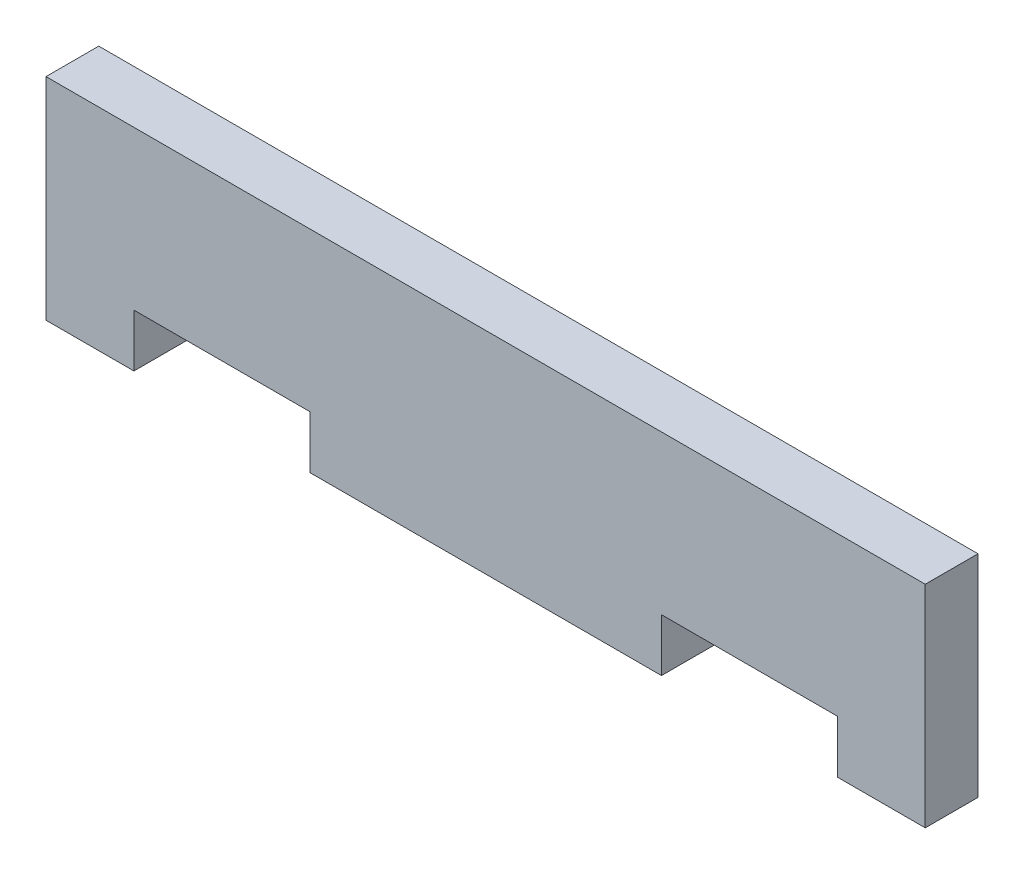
ISO-10303-21;
HEADER;
FILE_DESCRIPTION(('STEP AP214'),'2;1');
FILE_NAME('part.step','',(''),(''),'','','');
FILE_SCHEMA(('AUTOMOTIVE_DESIGN { 1 0 10303 214 1 1 1 1 }'));
ENDSEC;
DATA;
#1=APPLICATION_CONTEXT('core data for automotive mechanical design processes');
#2=APPLICATION_PROTOCOL_DEFINITION('international standard','automotive_design',2000,#1);
#3=PRODUCT_CONTEXT('',#1,'mechanical');
#4=PRODUCT('Part','Part','',(#3));
#5=PRODUCT_RELATED_PRODUCT_CATEGORY('part','',(#4));
#6=PRODUCT_DEFINITION_FORMATION('','',#4);
#7=PRODUCT_DEFINITION_CONTEXT('part definition',#1,'design');
#8=PRODUCT_DEFINITION('design','',#6,#7);
#9=PRODUCT_DEFINITION_SHAPE('','',#8);
#10=(LENGTH_UNIT() NAMED_UNIT(*) SI_UNIT(.MILLI.,.METRE.));
#11=(NAMED_UNIT(*) PLANE_ANGLE_UNIT() SI_UNIT($,.RADIAN.));
#12=(NAMED_UNIT(*) SI_UNIT($,.STERADIAN.) SOLID_ANGLE_UNIT());
#13=UNCERTAINTY_MEASURE_WITH_UNIT(LENGTH_MEASURE(1.E-05),#10,'distance_accuracy_value','');
#14=(GEOMETRIC_REPRESENTATION_CONTEXT(3) GLOBAL_UNCERTAINTY_ASSIGNED_CONTEXT((#13)) GLOBAL_UNIT_ASSIGNED_CONTEXT((#10,
#11,#12)) REPRESENTATION_CONTEXT('',''));
#15=CARTESIAN_POINT('',(0.,0.,0.));
#16=DIRECTION('',(0.,0.,1.));
#17=DIRECTION('',(1.,0.,0.));
#18=AXIS2_PLACEMENT_3D('',#15,#16,#17);
#19=CARTESIAN_POINT('',(0.,0.,3.));
#20=DIRECTION('',(0.,1.,0.));
#21=DIRECTION('',(0.,0.,1.));
#22=AXIS2_PLACEMENT_3D('',#19,#20,#21);
#23=PLANE('',#22);
#24=DIRECTION('',(0.,0.,1.));
#25=VECTOR('',#24,1.);
#26=CARTESIAN_POINT('',(45.,0.,0.));
#27=LINE('',#26,#25);
#28=CARTESIAN_POINT('',(45.,0.,0.));
#29=VERTEX_POINT('',#28);
#30=CARTESIAN_POINT('',(45.,0.,3.));
#31=VERTEX_POINT('',#30);
#32=EDGE_CURVE('E154',#29,#31,#27,.T.);
#33=ORIENTED_EDGE('',*,*,#32,.F.);
#34=DIRECTION('',(1.,0.,0.));
#35=VECTOR('',#34,1.);
#36=CARTESIAN_POINT('',(0.,0.,0.));
#37=LINE('',#36,#35);
#38=CARTESIAN_POINT('',(50.,0.,0.));
#39=VERTEX_POINT('',#38);
#40=EDGE_CURVE('E144',#29,#39,#37,.T.);
#41=ORIENTED_EDGE('',*,*,#40,.T.);
#42=DIRECTION('',(0.,0.,-1.));
#43=VECTOR('',#42,1.);
#44=CARTESIAN_POINT('',(50.,0.,3.));
#45=LINE('',#44,#43);
#46=CARTESIAN_POINT('',(50.,0.,3.));
#47=VERTEX_POINT('',#46);
#48=EDGE_CURVE('E44',#47,#39,#45,.T.);
#49=ORIENTED_EDGE('',*,*,#48,.F.);
#50=DIRECTION('',(1.,0.,0.));
#51=VECTOR('',#50,1.);
#52=CARTESIAN_POINT('',(0.,0.,3.));
#53=LINE('',#52,#51);
#54=EDGE_CURVE('E188',#31,#47,#53,.T.);
#55=ORIENTED_EDGE('',*,*,#54,.F.);
#56=EDGE_LOOP('',(#33,#41,#49,#55));
#57=FACE_BOUND('',#56,.T.);
#58=ADVANCED_FACE('F36',(#57),#23,.F.);
#59=DIRECTION('',(0.,0.,1.));
#60=VECTOR('',#59,1.);
#61=CARTESIAN_POINT('',(35.,0.,0.));
#62=LINE('',#61,#60);
#63=CARTESIAN_POINT('',(35.,0.,0.));
#64=VERTEX_POINT('',#63);
#65=CARTESIAN_POINT('',(35.,0.,3.));
#66=VERTEX_POINT('',#65);
#67=EDGE_CURVE('E157',#64,#66,#62,.T.);
#68=ORIENTED_EDGE('',*,*,#67,.T.);
#69=CARTESIAN_POINT('',(15.,0.,3.));
#70=VERTEX_POINT('',#69);
#71=EDGE_CURVE('E194',#70,#66,#53,.T.);
#72=ORIENTED_EDGE('',*,*,#71,.F.);
#73=DIRECTION('',(0.,0.,1.));
#74=VECTOR('',#73,1.);
#75=CARTESIAN_POINT('',(15.,0.,0.));
#76=LINE('',#75,#74);
#77=CARTESIAN_POINT('',(15.,0.,0.));
#78=VERTEX_POINT('',#77);
#79=EDGE_CURVE('E181',#78,#70,#76,.T.);
#80=ORIENTED_EDGE('',*,*,#79,.F.);
#81=EDGE_CURVE('E205',#78,#64,#37,.T.);
#82=ORIENTED_EDGE('',*,*,#81,.T.);
#83=EDGE_LOOP('',(#68,#72,#80,#82));
#84=FACE_BOUND('',#83,.T.);
#85=ADVANCED_FACE('F238',(#84),#23,.F.);
#86=CARTESIAN_POINT('',(0.,0.,3.));
#87=DIRECTION('',(0.,0.,-1.));
#88=DIRECTION('',(-1.,0.,0.));
#89=AXIS2_PLACEMENT_3D('',#86,#87,#88);
#90=PLANE('',#89);
#91=DIRECTION('',(0.,-1.,0.));
#92=VECTOR('',#91,1.);
#93=CARTESIAN_POINT('',(45.,0.,3.));
#94=LINE('',#93,#92);
#95=CARTESIAN_POINT('',(45.,3.,3.));
#96=VERTEX_POINT('',#95);
#97=EDGE_CURVE('E138',#96,#31,#94,.T.);
#98=ORIENTED_EDGE('',*,*,#97,.T.);
#99=ORIENTED_EDGE('',*,*,#54,.T.);
#100=DIRECTION('',(0.,1.,0.));
#101=VECTOR('',#100,1.);
#102=CARTESIAN_POINT('',(50.,0.,3.));
#103=LINE('',#102,#101);
#104=CARTESIAN_POINT('',(50.,12.,3.));
#105=VERTEX_POINT('',#104);
#106=EDGE_CURVE('E193',#47,#105,#103,.T.);
#107=ORIENTED_EDGE('',*,*,#106,.T.);
#108=DIRECTION('',(-1.,0.,0.));
#109=VECTOR('',#108,1.);
#110=CARTESIAN_POINT('',(0.,12.,3.));
#111=LINE('',#110,#109);
#112=CARTESIAN_POINT('',(0.,12.,3.));
#113=VERTEX_POINT('',#112);
#114=EDGE_CURVE('E196',#105,#113,#111,.T.);
#115=ORIENTED_EDGE('',*,*,#114,.T.);
#116=DIRECTION('',(0.,-1.,0.));
#117=VECTOR('',#116,1.);
#118=CARTESIAN_POINT('',(0.,0.,3.));
#119=LINE('',#118,#117);
#120=CARTESIAN_POINT('',(0.,0.,3.));
#121=VERTEX_POINT('',#120);
#122=EDGE_CURVE('E185',#113,#121,#119,.T.);
#123=ORIENTED_EDGE('',*,*,#122,.T.);
#124=CARTESIAN_POINT('',(5.,0.,3.));
#125=VERTEX_POINT('',#124);
#126=EDGE_CURVE('E190',#121,#125,#53,.T.);
#127=ORIENTED_EDGE('',*,*,#126,.T.);
#128=DIRECTION('',(0.,-1.,0.));
#129=VECTOR('',#128,1.);
#130=CARTESIAN_POINT('',(5.,0.,3.));
#131=LINE('',#130,#129);
#132=CARTESIAN_POINT('',(5.,3.,3.));
#133=VERTEX_POINT('',#132);
#134=EDGE_CURVE('E156',#133,#125,#131,.T.);
#135=ORIENTED_EDGE('',*,*,#134,.F.);
#136=DIRECTION('',(-1.,0.,0.));
#137=VECTOR('',#136,1.);
#138=CARTESIAN_POINT('',(5.,3.,3.));
#139=LINE('',#138,#137);
#140=CARTESIAN_POINT('',(15.,3.,3.));
#141=VERTEX_POINT('',#140);
#142=EDGE_CURVE('E165',#141,#133,#139,.T.);
#143=ORIENTED_EDGE('',*,*,#142,.F.);
#144=DIRECTION('',(0.,1.,0.));
#145=VECTOR('',#144,1.);
#146=CARTESIAN_POINT('',(15.,0.,3.));
#147=LINE('',#146,#145);
#148=EDGE_CURVE('E171',#70,#141,#147,.T.);
#149=ORIENTED_EDGE('',*,*,#148,.F.);
#150=ORIENTED_EDGE('',*,*,#71,.T.);
#151=DIRECTION('',(0.,1.,0.));
#152=VECTOR('',#151,1.);
#153=CARTESIAN_POINT('',(35.,0.,3.));
#154=LINE('',#153,#152);
#155=CARTESIAN_POINT('',(35.,3.,3.));
#156=VERTEX_POINT('',#155);
#157=EDGE_CURVE('E145',#66,#156,#154,.T.);
#158=ORIENTED_EDGE('',*,*,#157,.T.);
#159=DIRECTION('',(1.,0.,0.));
#160=VECTOR('',#159,1.);
#161=CARTESIAN_POINT('',(45.,3.,3.));
#162=LINE('',#161,#160);
#163=EDGE_CURVE('E148',#156,#96,#162,.T.);
#164=ORIENTED_EDGE('',*,*,#163,.T.);
#165=EDGE_LOOP('',(#98,#99,#107,#115,#123,#127,#135,#143,#149,#150,#158,#164));
#166=FACE_BOUND('',#165,.T.);
#167=ADVANCED_FACE('F230',(#166),#90,.F.);
#168=CARTESIAN_POINT('',(0.,0.,0.));
#169=DIRECTION('',(0.,0.,-1.));
#170=DIRECTION('',(-1.,0.,0.));
#171=AXIS2_PLACEMENT_3D('',#168,#169,#170);
#172=PLANE('',#171);
#173=ORIENTED_EDGE('',*,*,#40,.F.);
#174=DIRECTION('',(0.,-1.,0.));
#175=VECTOR('',#174,1.);
#176=CARTESIAN_POINT('',(45.,0.,0.));
#177=LINE('',#176,#175);
#178=CARTESIAN_POINT('',(45.,3.,0.));
#179=VERTEX_POINT('',#178);
#180=EDGE_CURVE('E132',#179,#29,#177,.T.);
#181=ORIENTED_EDGE('',*,*,#180,.F.);
#182=DIRECTION('',(1.,0.,0.));
#183=VECTOR('',#182,1.);
#184=CARTESIAN_POINT('',(45.,3.,0.));
#185=LINE('',#184,#183);
#186=CARTESIAN_POINT('',(35.,3.,0.));
#187=VERTEX_POINT('',#186);
#188=EDGE_CURVE('E123',#187,#179,#185,.T.);
#189=ORIENTED_EDGE('',*,*,#188,.F.);
#190=DIRECTION('',(0.,1.,0.));
#191=VECTOR('',#190,1.);
#192=CARTESIAN_POINT('',(35.,0.,0.));
#193=LINE('',#192,#191);
#194=EDGE_CURVE('E131',#64,#187,#193,.T.);
#195=ORIENTED_EDGE('',*,*,#194,.F.);
#196=ORIENTED_EDGE('',*,*,#81,.F.);
#197=DIRECTION('',(0.,1.,0.));
#198=VECTOR('',#197,1.);
#199=CARTESIAN_POINT('',(15.,0.,0.));
#200=LINE('',#199,#198);
#201=CARTESIAN_POINT('',(15.,3.,0.));
#202=VERTEX_POINT('',#201);
#203=EDGE_CURVE('E164',#78,#202,#200,.T.);
#204=ORIENTED_EDGE('',*,*,#203,.T.);
#205=DIRECTION('',(-1.,0.,0.));
#206=VECTOR('',#205,1.);
#207=CARTESIAN_POINT('',(5.,3.,0.));
#208=LINE('',#207,#206);
#209=CARTESIAN_POINT('',(5.,3.,0.));
#210=VERTEX_POINT('',#209);
#211=EDGE_CURVE('E59',#202,#210,#208,.T.);
#212=ORIENTED_EDGE('',*,*,#211,.T.);
#213=DIRECTION('',(0.,-1.,0.));
#214=VECTOR('',#213,1.);
#215=CARTESIAN_POINT('',(5.,0.,0.));
#216=LINE('',#215,#214);
#217=CARTESIAN_POINT('',(5.,0.,0.));
#218=VERTEX_POINT('',#217);
#219=EDGE_CURVE('E161',#210,#218,#216,.T.);
#220=ORIENTED_EDGE('',*,*,#219,.T.);
#221=CARTESIAN_POINT('',(0.,0.,0.));
#222=VERTEX_POINT('',#221);
#223=EDGE_CURVE('E201',#222,#218,#37,.T.);
#224=ORIENTED_EDGE('',*,*,#223,.F.);
#225=DIRECTION('',(0.,-1.,0.));
#226=VECTOR('',#225,1.);
#227=CARTESIAN_POINT('',(0.,0.,0.));
#228=LINE('',#227,#226);
#229=CARTESIAN_POINT('',(0.,12.,0.));
#230=VERTEX_POINT('',#229);
#231=EDGE_CURVE('E178',#230,#222,#228,.T.);
#232=ORIENTED_EDGE('',*,*,#231,.F.);
#233=DIRECTION('',(-1.,0.,0.));
#234=VECTOR('',#233,1.);
#235=CARTESIAN_POINT('',(0.,12.,0.));
#236=LINE('',#235,#234);
#237=CARTESIAN_POINT('',(50.,12.,0.));
#238=VERTEX_POINT('',#237);
#239=EDGE_CURVE('E189',#238,#230,#236,.T.);
#240=ORIENTED_EDGE('',*,*,#239,.F.);
#241=DIRECTION('',(0.,1.,0.));
#242=VECTOR('',#241,1.);
#243=CARTESIAN_POINT('',(50.,0.,0.));
#244=LINE('',#243,#242);
#245=EDGE_CURVE('E204',#39,#238,#244,.T.);
#246=ORIENTED_EDGE('',*,*,#245,.F.);
#247=EDGE_LOOP('',(#173,#181,#189,#195,#196,#204,#212,#220,#224,#232,#240,#246));
#248=FACE_BOUND('',#247,.T.);
#249=ADVANCED_FACE('F142',(#248),#172,.T.);
#250=ORIENTED_EDGE('',*,*,#223,.T.);
#251=DIRECTION('',(0.,0.,1.));
#252=VECTOR('',#251,1.);
#253=CARTESIAN_POINT('',(5.,0.,0.));
#254=LINE('',#253,#252);
#255=EDGE_CURVE('E169',#218,#125,#254,.T.);
#256=ORIENTED_EDGE('',*,*,#255,.T.);
#257=ORIENTED_EDGE('',*,*,#126,.F.);
#258=DIRECTION('',(0.,0.,-1.));
#259=VECTOR('',#258,1.);
#260=CARTESIAN_POINT('',(0.,0.,3.));
#261=LINE('',#260,#259);
#262=EDGE_CURVE('E11',#121,#222,#261,.T.);
#263=ORIENTED_EDGE('',*,*,#262,.T.);
#264=EDGE_LOOP('',(#250,#256,#257,#263));
#265=FACE_BOUND('',#264,.T.);
#266=ADVANCED_FACE('F244',(#265),#23,.F.);
#267=CARTESIAN_POINT('',(0.,0.,3.));
#268=DIRECTION('',(1.,0.,0.));
#269=DIRECTION('',(0.,0.,-1.));
#270=AXIS2_PLACEMENT_3D('',#267,#268,#269);
#271=PLANE('',#270);
#272=ORIENTED_EDGE('',*,*,#231,.T.);
#273=ORIENTED_EDGE('',*,*,#262,.F.);
#274=ORIENTED_EDGE('',*,*,#122,.F.);
#275=DIRECTION('',(0.,0.,-1.));
#276=VECTOR('',#275,1.);
#277=CARTESIAN_POINT('',(0.,12.,3.));
#278=LINE('',#277,#276);
#279=EDGE_CURVE('E198',#113,#230,#278,.T.);
#280=ORIENTED_EDGE('',*,*,#279,.T.);
#281=EDGE_LOOP('',(#272,#273,#274,#280));
#282=FACE_BOUND('',#281,.T.);
#283=ADVANCED_FACE('F38',(#282),#271,.F.);
#284=CARTESIAN_POINT('',(50.,0.,3.));
#285=DIRECTION('',(-1.,0.,0.));
#286=DIRECTION('',(0.,0.,1.));
#287=AXIS2_PLACEMENT_3D('',#284,#285,#286);
#288=PLANE('',#287);
#289=ORIENTED_EDGE('',*,*,#245,.T.);
#290=DIRECTION('',(0.,0.,-1.));
#291=VECTOR('',#290,1.);
#292=CARTESIAN_POINT('',(50.,12.,3.));
#293=LINE('',#292,#291);
#294=EDGE_CURVE('E210',#105,#238,#293,.T.);
#295=ORIENTED_EDGE('',*,*,#294,.F.);
#296=ORIENTED_EDGE('',*,*,#106,.F.);
#297=ORIENTED_EDGE('',*,*,#48,.T.);
#298=EDGE_LOOP('',(#289,#295,#296,#297));
#299=FACE_BOUND('',#298,.T.);
#300=ADVANCED_FACE('F216',(#299),#288,.F.);
#301=CARTESIAN_POINT('',(0.,12.,3.));
#302=DIRECTION('',(0.,-1.,0.));
#303=DIRECTION('',(0.,0.,-1.));
#304=AXIS2_PLACEMENT_3D('',#301,#302,#303);
#305=PLANE('',#304);
#306=ORIENTED_EDGE('',*,*,#239,.T.);
#307=ORIENTED_EDGE('',*,*,#279,.F.);
#308=ORIENTED_EDGE('',*,*,#114,.F.);
#309=ORIENTED_EDGE('',*,*,#294,.T.);
#310=EDGE_LOOP('',(#306,#307,#308,#309));
#311=FACE_BOUND('',#310,.T.);
#312=ADVANCED_FACE('F224',(#311),#305,.F.);
#313=CARTESIAN_POINT('',(5.,0.,0.));
#314=DIRECTION('',(-1.,0.,0.));
#315=DIRECTION('',(0.,0.,1.));
#316=AXIS2_PLACEMENT_3D('',#313,#314,#315);
#317=PLANE('',#316);
#318=ORIENTED_EDGE('',*,*,#134,.T.);
#319=ORIENTED_EDGE('',*,*,#255,.F.);
#320=ORIENTED_EDGE('',*,*,#219,.F.);
#321=DIRECTION('',(0.,0.,1.));
#322=VECTOR('',#321,1.);
#323=CARTESIAN_POINT('',(5.,3.,0.));
#324=LINE('',#323,#322);
#325=EDGE_CURVE('E176',#210,#133,#324,.T.);
#326=ORIENTED_EDGE('',*,*,#325,.T.);
#327=EDGE_LOOP('',(#318,#319,#320,#326));
#328=FACE_BOUND('',#327,.T.);
#329=ADVANCED_FACE('F258',(#328),#317,.F.);
#330=CARTESIAN_POINT('',(5.,3.,0.));
#331=DIRECTION('',(0.,1.,0.));
#332=DIRECTION('',(-1.,0.,0.));
#333=AXIS2_PLACEMENT_3D('',#330,#331,#332);
#334=PLANE('',#333);
#335=ORIENTED_EDGE('',*,*,#142,.T.);
#336=ORIENTED_EDGE('',*,*,#325,.F.);
#337=ORIENTED_EDGE('',*,*,#211,.F.);
#338=DIRECTION('',(0.,0.,1.));
#339=VECTOR('',#338,1.);
#340=CARTESIAN_POINT('',(15.,3.,0.));
#341=LINE('',#340,#339);
#342=EDGE_CURVE('E179',#202,#141,#341,.T.);
#343=ORIENTED_EDGE('',*,*,#342,.T.);
#344=EDGE_LOOP('',(#335,#336,#337,#343));
#345=FACE_BOUND('',#344,.T.);
#346=ADVANCED_FACE('F259',(#345),#334,.F.);
#347=CARTESIAN_POINT('',(15.,0.,0.));
#348=DIRECTION('',(1.,0.,0.));
#349=DIRECTION('',(0.,0.,-1.));
#350=AXIS2_PLACEMENT_3D('',#347,#348,#349);
#351=PLANE('',#350);
#352=ORIENTED_EDGE('',*,*,#148,.T.);
#353=ORIENTED_EDGE('',*,*,#342,.F.);
#354=ORIENTED_EDGE('',*,*,#203,.F.);
#355=ORIENTED_EDGE('',*,*,#79,.T.);
#356=EDGE_LOOP('',(#352,#353,#354,#355));
#357=FACE_BOUND('',#356,.T.);
#358=ADVANCED_FACE('F261',(#357),#351,.F.);
#359=CARTESIAN_POINT('',(45.,0.,0.));
#360=DIRECTION('',(-1.,0.,0.));
#361=DIRECTION('',(0.,0.,1.));
#362=AXIS2_PLACEMENT_3D('',#359,#360,#361);
#363=PLANE('',#362);
#364=ORIENTED_EDGE('',*,*,#97,.F.);
#365=DIRECTION('',(0.,0.,1.));
#366=VECTOR('',#365,1.);
#367=CARTESIAN_POINT('',(45.,3.,0.));
#368=LINE('',#367,#366);
#369=EDGE_CURVE('E126',#179,#96,#368,.T.);
#370=ORIENTED_EDGE('',*,*,#369,.F.);
#371=ORIENTED_EDGE('',*,*,#180,.T.);
#372=ORIENTED_EDGE('',*,*,#32,.T.);
#373=EDGE_LOOP('',(#364,#370,#371,#372));
#374=FACE_BOUND('',#373,.T.);
#375=ADVANCED_FACE('F135',(#374),#363,.T.);
#376=CARTESIAN_POINT('',(35.,0.,0.));
#377=DIRECTION('',(1.,0.,0.));
#378=DIRECTION('',(0.,0.,-1.));
#379=AXIS2_PLACEMENT_3D('',#376,#377,#378);
#380=PLANE('',#379);
#381=ORIENTED_EDGE('',*,*,#157,.F.);
#382=ORIENTED_EDGE('',*,*,#67,.F.);
#383=ORIENTED_EDGE('',*,*,#194,.T.);
#384=DIRECTION('',(0.,0.,1.));
#385=VECTOR('',#384,1.);
#386=CARTESIAN_POINT('',(35.,3.,0.));
#387=LINE('',#386,#385);
#388=EDGE_CURVE('E51',#187,#156,#387,.T.);
#389=ORIENTED_EDGE('',*,*,#388,.T.);
#390=EDGE_LOOP('',(#381,#382,#383,#389));
#391=FACE_BOUND('',#390,.T.);
#392=ADVANCED_FACE('F242',(#391),#380,.T.);
#393=CARTESIAN_POINT('',(45.,3.,0.));
#394=DIRECTION('',(0.,-1.,0.));
#395=DIRECTION('',(1.,0.,0.));
#396=AXIS2_PLACEMENT_3D('',#393,#394,#395);
#397=PLANE('',#396);
#398=ORIENTED_EDGE('',*,*,#163,.F.);
#399=ORIENTED_EDGE('',*,*,#388,.F.);
#400=ORIENTED_EDGE('',*,*,#188,.T.);
#401=ORIENTED_EDGE('',*,*,#369,.T.);
#402=EDGE_LOOP('',(#398,#399,#400,#401));
#403=FACE_BOUND('',#402,.T.);
#404=ADVANCED_FACE('F125',(#403),#397,.T.);
#405=CLOSED_SHELL('',(#58,#85,#167,#249,#266,#283,#300,#312,#329,#346,#358,#375,#392,#404));
#406=MANIFOLD_SOLID_BREP('B2',#405);
#407=ADVANCED_BREP_SHAPE_REPRESENTATION('',(#18,#406),#14);
#408=SHAPE_DEFINITION_REPRESENTATION(#9,#407);
ENDSEC;
END-ISO-10303-21;
